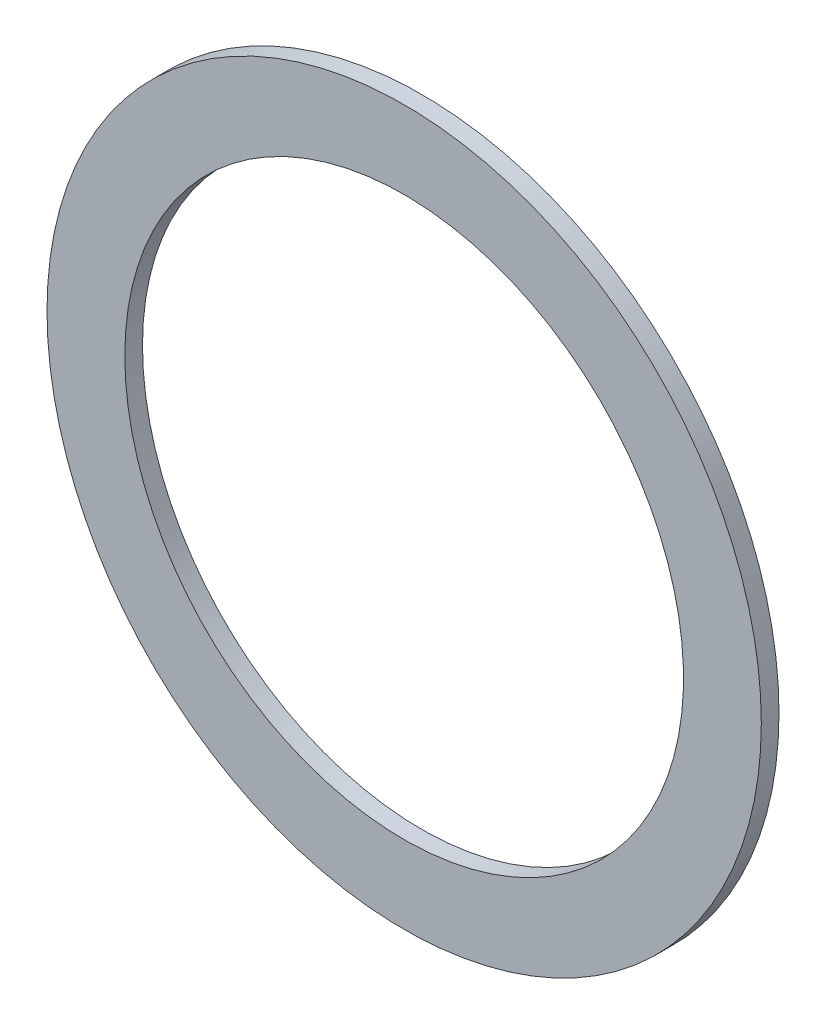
ISO-10303-21;
HEADER;
FILE_DESCRIPTION(('STEP AP214'),'2;1');
FILE_NAME('part.step','',(''),(''),'','','');
FILE_SCHEMA(('AUTOMOTIVE_DESIGN { 1 0 10303 214 1 1 1 1 }'));
ENDSEC;
DATA;
#1=APPLICATION_CONTEXT('core data for automotive mechanical design processes');
#2=APPLICATION_PROTOCOL_DEFINITION('international standard','automotive_design',2000,#1);
#3=PRODUCT_CONTEXT('',#1,'mechanical');
#4=PRODUCT('Part','Part','',(#3));
#5=PRODUCT_RELATED_PRODUCT_CATEGORY('part','',(#4));
#6=PRODUCT_DEFINITION_FORMATION('','',#4);
#7=PRODUCT_DEFINITION_CONTEXT('part definition',#1,'design');
#8=PRODUCT_DEFINITION('design','',#6,#7);
#9=PRODUCT_DEFINITION_SHAPE('','',#8);
#10=(LENGTH_UNIT() NAMED_UNIT(*) SI_UNIT(.MILLI.,.METRE.));
#11=(NAMED_UNIT(*) PLANE_ANGLE_UNIT() SI_UNIT($,.RADIAN.));
#12=(NAMED_UNIT(*) SI_UNIT($,.STERADIAN.) SOLID_ANGLE_UNIT());
#13=UNCERTAINTY_MEASURE_WITH_UNIT(LENGTH_MEASURE(1.E-05),#10,'distance_accuracy_value','');
#14=(GEOMETRIC_REPRESENTATION_CONTEXT(3) GLOBAL_UNCERTAINTY_ASSIGNED_CONTEXT((#13)) GLOBAL_UNIT_ASSIGNED_CONTEXT((#10,
#11,#12)) REPRESENTATION_CONTEXT('',''));
#15=CARTESIAN_POINT('',(0.,0.,0.));
#16=DIRECTION('',(0.,0.,1.));
#17=DIRECTION('',(1.,0.,0.));
#18=AXIS2_PLACEMENT_3D('',#15,#16,#17);
#19=CARTESIAN_POINT('',(0.,0.,0.));
#20=DIRECTION('',(0.,0.,-1.));
#21=DIRECTION('',(-1.,0.,0.));
#22=AXIS2_PLACEMENT_3D('',#19,#20,#21);
#23=CYLINDRICAL_SURFACE('',#22,20.2);
#24=CARTESIAN_POINT('',(0.,0.,0.));
#25=DIRECTION('',(0.,0.,-1.));
#26=DIRECTION('',(-1.,0.,0.));
#27=AXIS2_PLACEMENT_3D('',#24,#25,#26);
#28=CIRCLE('',#27,20.2);
#29=CARTESIAN_POINT('',(-20.2,0.,0.));
#30=VERTEX_POINT('',#29);
#31=EDGE_CURVE('E48',#30,#30,#28,.T.);
#32=ORIENTED_EDGE('',*,*,#31,.F.);
#33=EDGE_LOOP('',(#32));
#34=FACE_BOUND('',#33,.T.);
#35=CARTESIAN_POINT('',(0.,0.,1.));
#36=DIRECTION('',(0.,0.,-1.));
#37=DIRECTION('',(-1.,0.,0.));
#38=AXIS2_PLACEMENT_3D('',#35,#36,#37);
#39=CIRCLE('',#38,20.2);
#40=CARTESIAN_POINT('',(-20.2,0.,1.));
#41=VERTEX_POINT('',#40);
#42=EDGE_CURVE('E10',#41,#41,#39,.T.);
#43=ORIENTED_EDGE('',*,*,#42,.T.);
#44=EDGE_LOOP('',(#43));
#45=FACE_BOUND('',#44,.T.);
#46=ADVANCED_FACE('F34',(#34,#45),#23,.T.);
#47=CARTESIAN_POINT('',(20.2,0.,1.));
#48=DIRECTION('',(0.,0.,-1.));
#49=DIRECTION('',(-1.,0.,0.));
#50=AXIS2_PLACEMENT_3D('',#47,#48,#49);
#51=PLANE('',#50);
#52=ORIENTED_EDGE('',*,*,#42,.F.);
#53=EDGE_LOOP('',(#52));
#54=FACE_BOUND('',#53,.T.);
#55=CARTESIAN_POINT('',(0.,0.,1.));
#56=DIRECTION('',(0.,0.,-1.));
#57=DIRECTION('',(-1.,0.,0.));
#58=AXIS2_PLACEMENT_3D('',#55,#56,#57);
#59=CIRCLE('',#58,15.8);
#60=CARTESIAN_POINT('',(-15.8,0.,1.));
#61=VERTEX_POINT('',#60);
#62=EDGE_CURVE('E40',#61,#61,#59,.T.);
#63=ORIENTED_EDGE('',*,*,#62,.T.);
#64=EDGE_LOOP('',(#63));
#65=FACE_BOUND('',#64,.T.);
#66=ADVANCED_FACE('F57',(#54,#65),#51,.F.);
#67=CARTESIAN_POINT('',(0.,0.,0.));
#68=DIRECTION('',(0.,0.,-1.));
#69=DIRECTION('',(-1.,0.,0.));
#70=AXIS2_PLACEMENT_3D('',#67,#68,#69);
#71=CYLINDRICAL_SURFACE('',#70,15.8);
#72=ORIENTED_EDGE('',*,*,#62,.F.);
#73=EDGE_LOOP('',(#72));
#74=FACE_BOUND('',#73,.T.);
#75=CARTESIAN_POINT('',(0.,0.,0.));
#76=DIRECTION('',(0.,0.,-1.));
#77=DIRECTION('',(-1.,0.,0.));
#78=AXIS2_PLACEMENT_3D('',#75,#76,#77);
#79=CIRCLE('',#78,15.8);
#80=CARTESIAN_POINT('',(-15.8,0.,0.));
#81=VERTEX_POINT('',#80);
#82=EDGE_CURVE('E44',#81,#81,#79,.T.);
#83=ORIENTED_EDGE('',*,*,#82,.T.);
#84=EDGE_LOOP('',(#83));
#85=FACE_BOUND('',#84,.T.);
#86=ADVANCED_FACE('F61',(#74,#85),#71,.F.);
#87=CARTESIAN_POINT('',(20.2,0.,0.));
#88=DIRECTION('',(0.,0.,1.));
#89=DIRECTION('',(1.,0.,0.));
#90=AXIS2_PLACEMENT_3D('',#87,#88,#89);
#91=PLANE('',#90);
#92=ORIENTED_EDGE('',*,*,#82,.F.);
#93=EDGE_LOOP('',(#92));
#94=FACE_BOUND('',#93,.T.);
#95=ORIENTED_EDGE('',*,*,#31,.T.);
#96=EDGE_LOOP('',(#95));
#97=FACE_BOUND('',#96,.T.);
#98=ADVANCED_FACE('F54',(#94,#97),#91,.F.);
#99=CLOSED_SHELL('',(#46,#66,#86,#98));
#100=MANIFOLD_SOLID_BREP('B2',#99);
#101=ADVANCED_BREP_SHAPE_REPRESENTATION('',(#18,#100),#14);
#102=SHAPE_DEFINITION_REPRESENTATION(#9,#101);
ENDSEC;
END-ISO-10303-21;
